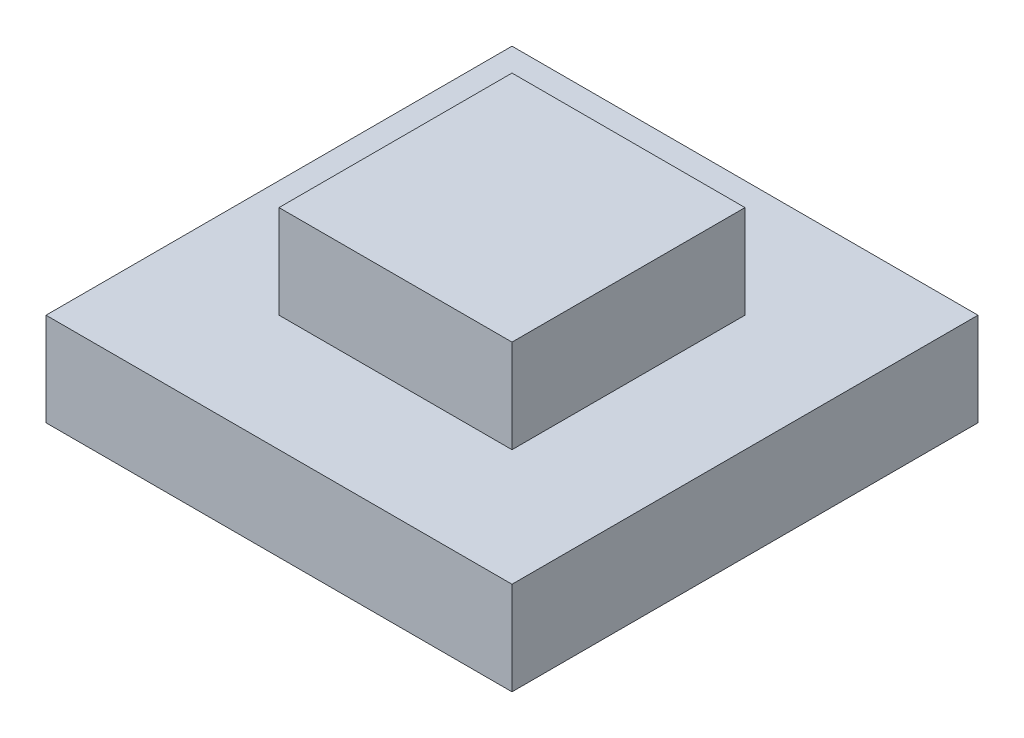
ISO-10303-21;
HEADER;
FILE_DESCRIPTION(('STEP AP214'),'2;1');
FILE_NAME('part.step','',(''),(''),'','','');
FILE_SCHEMA(('AUTOMOTIVE_DESIGN { 1 0 10303 214 1 1 1 1 }'));
ENDSEC;
DATA;
#1=APPLICATION_CONTEXT('core data for automotive mechanical design processes');
#2=APPLICATION_PROTOCOL_DEFINITION('international standard','automotive_design',2000,#1);
#3=PRODUCT_CONTEXT('',#1,'mechanical');
#4=PRODUCT('Part','Part','',(#3));
#5=PRODUCT_RELATED_PRODUCT_CATEGORY('part','',(#4));
#6=PRODUCT_DEFINITION_FORMATION('','',#4);
#7=PRODUCT_DEFINITION_CONTEXT('part definition',#1,'design');
#8=PRODUCT_DEFINITION('design','',#6,#7);
#9=PRODUCT_DEFINITION_SHAPE('','',#8);
#10=(LENGTH_UNIT() NAMED_UNIT(*) SI_UNIT(.MILLI.,.METRE.));
#11=(NAMED_UNIT(*) PLANE_ANGLE_UNIT() SI_UNIT($,.RADIAN.));
#12=(NAMED_UNIT(*) SI_UNIT($,.STERADIAN.) SOLID_ANGLE_UNIT());
#13=UNCERTAINTY_MEASURE_WITH_UNIT(LENGTH_MEASURE(1.E-05),#10,'distance_accuracy_value','');
#14=(GEOMETRIC_REPRESENTATION_CONTEXT(3) GLOBAL_UNCERTAINTY_ASSIGNED_CONTEXT((#13)) GLOBAL_UNIT_ASSIGNED_CONTEXT((#10,
#11,#12)) REPRESENTATION_CONTEXT('',''));
#15=CARTESIAN_POINT('',(0.,0.,0.));
#16=DIRECTION('',(0.,0.,1.));
#17=DIRECTION('',(1.,0.,0.));
#18=AXIS2_PLACEMENT_3D('',#15,#16,#17);
#19=CARTESIAN_POINT('',(-25.,40.,25.));
#20=DIRECTION('',(1.,0.,0.));
#21=DIRECTION('',(0.,0.,-1.));
#22=AXIS2_PLACEMENT_3D('',#19,#20,#21);
#23=PLANE('',#22);
#24=DIRECTION('',(0.,0.,1.));
#25=VECTOR('',#24,1.);
#26=CARTESIAN_POINT('',(-25.,20.,25.));
#27=LINE('',#26,#25);
#28=CARTESIAN_POINT('',(-25.,20.,-25.));
#29=VERTEX_POINT('',#28);
#30=CARTESIAN_POINT('',(-25.,20.,25.));
#31=VERTEX_POINT('',#30);
#32=EDGE_CURVE('E116',#29,#31,#27,.T.);
#33=ORIENTED_EDGE('',*,*,#32,.T.);
#34=DIRECTION('',(0.,-1.,0.));
#35=VECTOR('',#34,1.);
#36=CARTESIAN_POINT('',(-25.,40.,25.));
#37=LINE('',#36,#35);
#38=CARTESIAN_POINT('',(-25.,40.,25.));
#39=VERTEX_POINT('',#38);
#40=EDGE_CURVE('E12',#39,#31,#37,.T.);
#41=ORIENTED_EDGE('',*,*,#40,.F.);
#42=DIRECTION('',(0.,0.,1.));
#43=VECTOR('',#42,1.);
#44=CARTESIAN_POINT('',(-25.,40.,25.));
#45=LINE('',#44,#43);
#46=CARTESIAN_POINT('',(-25.,40.,-25.));
#47=VERTEX_POINT('',#46);
#48=EDGE_CURVE('E104',#47,#39,#45,.T.);
#49=ORIENTED_EDGE('',*,*,#48,.F.);
#50=DIRECTION('',(0.,-1.,0.));
#51=VECTOR('',#50,1.);
#52=CARTESIAN_POINT('',(-25.,40.,-25.));
#53=LINE('',#52,#51);
#54=EDGE_CURVE('E112',#47,#29,#53,.T.);
#55=ORIENTED_EDGE('',*,*,#54,.T.);
#56=EDGE_LOOP('',(#33,#41,#49,#55));
#57=FACE_BOUND('',#56,.T.);
#58=ADVANCED_FACE('F53',(#57),#23,.F.);
#59=CARTESIAN_POINT('',(25.,40.,25.));
#60=DIRECTION('',(0.,0.,-1.));
#61=DIRECTION('',(-1.,0.,0.));
#62=AXIS2_PLACEMENT_3D('',#59,#60,#61);
#63=PLANE('',#62);
#64=DIRECTION('',(1.,0.,0.));
#65=VECTOR('',#64,1.);
#66=CARTESIAN_POINT('',(25.,20.,25.));
#67=LINE('',#66,#65);
#68=CARTESIAN_POINT('',(25.,20.,25.));
#69=VERTEX_POINT('',#68);
#70=EDGE_CURVE('E108',#31,#69,#67,.T.);
#71=ORIENTED_EDGE('',*,*,#70,.T.);
#72=DIRECTION('',(0.,-1.,0.));
#73=VECTOR('',#72,1.);
#74=CARTESIAN_POINT('',(25.,40.,25.));
#75=LINE('',#74,#73);
#76=CARTESIAN_POINT('',(25.,40.,25.));
#77=VERTEX_POINT('',#76);
#78=EDGE_CURVE('E61',#77,#69,#75,.T.);
#79=ORIENTED_EDGE('',*,*,#78,.F.);
#80=DIRECTION('',(1.,0.,0.));
#81=VECTOR('',#80,1.);
#82=CARTESIAN_POINT('',(25.,40.,25.));
#83=LINE('',#82,#81);
#84=EDGE_CURVE('E99',#39,#77,#83,.T.);
#85=ORIENTED_EDGE('',*,*,#84,.F.);
#86=ORIENTED_EDGE('',*,*,#40,.T.);
#87=EDGE_LOOP('',(#71,#79,#85,#86));
#88=FACE_BOUND('',#87,.T.);
#89=ADVANCED_FACE('F107',(#88),#63,.F.);
#90=CARTESIAN_POINT('',(25.,40.,25.));
#91=DIRECTION('',(-1.,0.,0.));
#92=DIRECTION('',(0.,0.,1.));
#93=AXIS2_PLACEMENT_3D('',#90,#91,#92);
#94=PLANE('',#93);
#95=DIRECTION('',(0.,0.,-1.));
#96=VECTOR('',#95,1.);
#97=CARTESIAN_POINT('',(25.,20.,25.));
#98=LINE('',#97,#96);
#99=CARTESIAN_POINT('',(25.,20.,-25.));
#100=VERTEX_POINT('',#99);
#101=EDGE_CURVE('E86',#69,#100,#98,.T.);
#102=ORIENTED_EDGE('',*,*,#101,.T.);
#103=DIRECTION('',(0.,-1.,0.));
#104=VECTOR('',#103,1.);
#105=CARTESIAN_POINT('',(25.,40.,-25.));
#106=LINE('',#105,#104);
#107=CARTESIAN_POINT('',(25.,40.,-25.));
#108=VERTEX_POINT('',#107);
#109=EDGE_CURVE('E109',#108,#100,#106,.T.);
#110=ORIENTED_EDGE('',*,*,#109,.F.);
#111=DIRECTION('',(0.,0.,-1.));
#112=VECTOR('',#111,1.);
#113=CARTESIAN_POINT('',(25.,40.,25.));
#114=LINE('',#113,#112);
#115=EDGE_CURVE('E102',#77,#108,#114,.T.);
#116=ORIENTED_EDGE('',*,*,#115,.F.);
#117=ORIENTED_EDGE('',*,*,#78,.T.);
#118=EDGE_LOOP('',(#102,#110,#116,#117));
#119=FACE_BOUND('',#118,.T.);
#120=ADVANCED_FACE('F110',(#119),#94,.F.);
#121=CARTESIAN_POINT('',(25.,40.,-25.));
#122=DIRECTION('',(0.,0.,1.));
#123=DIRECTION('',(1.,0.,0.));
#124=AXIS2_PLACEMENT_3D('',#121,#122,#123);
#125=PLANE('',#124);
#126=DIRECTION('',(-1.,0.,0.));
#127=VECTOR('',#126,1.);
#128=CARTESIAN_POINT('',(25.,20.,-25.));
#129=LINE('',#128,#127);
#130=EDGE_CURVE('E92',#100,#29,#129,.T.);
#131=ORIENTED_EDGE('',*,*,#130,.T.);
#132=ORIENTED_EDGE('',*,*,#54,.F.);
#133=DIRECTION('',(-1.,0.,0.));
#134=VECTOR('',#133,1.);
#135=CARTESIAN_POINT('',(25.,40.,-25.));
#136=LINE('',#135,#134);
#137=EDGE_CURVE('E69',#108,#47,#136,.T.);
#138=ORIENTED_EDGE('',*,*,#137,.F.);
#139=ORIENTED_EDGE('',*,*,#109,.T.);
#140=EDGE_LOOP('',(#131,#132,#138,#139));
#141=FACE_BOUND('',#140,.T.);
#142=ADVANCED_FACE('F123',(#141),#125,.F.);
#143=CARTESIAN_POINT('',(0.,40.,0.));
#144=DIRECTION('',(0.,1.,0.));
#145=DIRECTION('',(0.,0.,1.));
#146=AXIS2_PLACEMENT_3D('',#143,#144,#145);
#147=PLANE('',#146);
#148=ORIENTED_EDGE('',*,*,#48,.T.);
#149=ORIENTED_EDGE('',*,*,#84,.T.);
#150=ORIENTED_EDGE('',*,*,#115,.T.);
#151=ORIENTED_EDGE('',*,*,#137,.T.);
#152=EDGE_LOOP('',(#148,#149,#150,#151));
#153=FACE_BOUND('',#152,.T.);
#154=ADVANCED_FACE('F100',(#153),#147,.T.);
#155=CARTESIAN_POINT('',(0.,20.,0.));
#156=DIRECTION('',(0.,1.,0.));
#157=DIRECTION('',(0.,0.,1.));
#158=AXIS2_PLACEMENT_3D('',#155,#156,#157);
#159=PLANE('',#158);
#160=ORIENTED_EDGE('',*,*,#32,.F.);
#161=ORIENTED_EDGE('',*,*,#130,.F.);
#162=ORIENTED_EDGE('',*,*,#101,.F.);
#163=ORIENTED_EDGE('',*,*,#70,.F.);
#164=EDGE_LOOP('',(#160,#161,#162,#163));
#165=FACE_BOUND('',#164,.T.);
#166=ADVANCED_FACE('F126',(#165),#159,.F.);
#167=CLOSED_SHELL('',(#58,#89,#120,#142,#154,#166));
#168=MANIFOLD_SOLID_BREP('B2',#167);
#169=CARTESIAN_POINT('',(-50.,20.,50.));
#170=DIRECTION('',(1.,0.,0.));
#171=DIRECTION('',(0.,0.,-1.));
#172=AXIS2_PLACEMENT_3D('',#169,#170,#171);
#173=PLANE('',#172);
#174=DIRECTION('',(0.,0.,1.));
#175=VECTOR('',#174,1.);
#176=CARTESIAN_POINT('',(-50.,0.,50.));
#177=LINE('',#176,#175);
#178=CARTESIAN_POINT('',(-50.,0.,-50.));
#179=VERTEX_POINT('',#178);
#180=CARTESIAN_POINT('',(-50.,0.,50.));
#181=VERTEX_POINT('',#180);
#182=EDGE_CURVE('E233',#179,#181,#177,.T.);
#183=ORIENTED_EDGE('',*,*,#182,.T.);
#184=DIRECTION('',(0.,-1.,0.));
#185=VECTOR('',#184,1.);
#186=CARTESIAN_POINT('',(-50.,20.,50.));
#187=LINE('',#186,#185);
#188=CARTESIAN_POINT('',(-50.,20.,50.));
#189=VERTEX_POINT('',#188);
#190=EDGE_CURVE('E51',#189,#181,#187,.T.);
#191=ORIENTED_EDGE('',*,*,#190,.F.);
#192=DIRECTION('',(0.,0.,1.));
#193=VECTOR('',#192,1.);
#194=CARTESIAN_POINT('',(-50.,20.,50.));
#195=LINE('',#194,#193);
#196=CARTESIAN_POINT('',(-50.,20.,-50.));
#197=VERTEX_POINT('',#196);
#198=EDGE_CURVE('E217',#197,#189,#195,.T.);
#199=ORIENTED_EDGE('',*,*,#198,.F.);
#200=DIRECTION('',(0.,-1.,0.));
#201=VECTOR('',#200,1.);
#202=CARTESIAN_POINT('',(-50.,20.,-50.));
#203=LINE('',#202,#201);
#204=EDGE_CURVE('E229',#197,#179,#203,.T.);
#205=ORIENTED_EDGE('',*,*,#204,.T.);
#206=EDGE_LOOP('',(#183,#191,#199,#205));
#207=FACE_BOUND('',#206,.T.);
#208=ADVANCED_FACE('F165',(#207),#173,.F.);
#209=CARTESIAN_POINT('',(50.,20.,50.));
#210=DIRECTION('',(0.,0.,-1.));
#211=DIRECTION('',(-1.,0.,0.));
#212=AXIS2_PLACEMENT_3D('',#209,#210,#211);
#213=PLANE('',#212);
#214=DIRECTION('',(1.,0.,0.));
#215=VECTOR('',#214,1.);
#216=CARTESIAN_POINT('',(50.,0.,50.));
#217=LINE('',#216,#215);
#218=CARTESIAN_POINT('',(50.,0.,50.));
#219=VERTEX_POINT('',#218);
#220=EDGE_CURVE('E222',#181,#219,#217,.T.);
#221=ORIENTED_EDGE('',*,*,#220,.T.);
#222=DIRECTION('',(0.,-1.,0.));
#223=VECTOR('',#222,1.);
#224=CARTESIAN_POINT('',(50.,20.,50.));
#225=LINE('',#224,#223);
#226=CARTESIAN_POINT('',(50.,20.,50.));
#227=VERTEX_POINT('',#226);
#228=EDGE_CURVE('E174',#227,#219,#225,.T.);
#229=ORIENTED_EDGE('',*,*,#228,.F.);
#230=DIRECTION('',(1.,0.,0.));
#231=VECTOR('',#230,1.);
#232=CARTESIAN_POINT('',(50.,20.,50.));
#233=LINE('',#232,#231);
#234=EDGE_CURVE('E212',#189,#227,#233,.T.);
#235=ORIENTED_EDGE('',*,*,#234,.F.);
#236=ORIENTED_EDGE('',*,*,#190,.T.);
#237=EDGE_LOOP('',(#221,#229,#235,#236));
#238=FACE_BOUND('',#237,.T.);
#239=ADVANCED_FACE('F221',(#238),#213,.F.);
#240=CARTESIAN_POINT('',(50.,20.,50.));
#241=DIRECTION('',(-1.,0.,0.));
#242=DIRECTION('',(0.,0.,1.));
#243=AXIS2_PLACEMENT_3D('',#240,#241,#242);
#244=PLANE('',#243);
#245=DIRECTION('',(0.,0.,-1.));
#246=VECTOR('',#245,1.);
#247=CARTESIAN_POINT('',(50.,0.,50.));
#248=LINE('',#247,#246);
#249=CARTESIAN_POINT('',(50.,0.,-50.));
#250=VERTEX_POINT('',#249);
#251=EDGE_CURVE('E199',#219,#250,#248,.T.);
#252=ORIENTED_EDGE('',*,*,#251,.T.);
#253=DIRECTION('',(0.,-1.,0.));
#254=VECTOR('',#253,1.);
#255=CARTESIAN_POINT('',(50.,20.,-50.));
#256=LINE('',#255,#254);
#257=CARTESIAN_POINT('',(50.,20.,-50.));
#258=VERTEX_POINT('',#257);
#259=EDGE_CURVE('E224',#258,#250,#256,.T.);
#260=ORIENTED_EDGE('',*,*,#259,.F.);
#261=DIRECTION('',(0.,0.,-1.));
#262=VECTOR('',#261,1.);
#263=CARTESIAN_POINT('',(50.,20.,50.));
#264=LINE('',#263,#262);
#265=EDGE_CURVE('E215',#227,#258,#264,.T.);
#266=ORIENTED_EDGE('',*,*,#265,.F.);
#267=ORIENTED_EDGE('',*,*,#228,.T.);
#268=EDGE_LOOP('',(#252,#260,#266,#267));
#269=FACE_BOUND('',#268,.T.);
#270=ADVANCED_FACE('F225',(#269),#244,.F.);
#271=CARTESIAN_POINT('',(50.,20.,-50.));
#272=DIRECTION('',(0.,0.,1.));
#273=DIRECTION('',(1.,0.,0.));
#274=AXIS2_PLACEMENT_3D('',#271,#272,#273);
#275=PLANE('',#274);
#276=DIRECTION('',(-1.,0.,0.));
#277=VECTOR('',#276,1.);
#278=CARTESIAN_POINT('',(50.,0.,-50.));
#279=LINE('',#278,#277);
#280=EDGE_CURVE('E205',#250,#179,#279,.T.);
#281=ORIENTED_EDGE('',*,*,#280,.T.);
#282=ORIENTED_EDGE('',*,*,#204,.F.);
#283=DIRECTION('',(-1.,0.,0.));
#284=VECTOR('',#283,1.);
#285=CARTESIAN_POINT('',(50.,20.,-50.));
#286=LINE('',#285,#284);
#287=EDGE_CURVE('E182',#258,#197,#286,.T.);
#288=ORIENTED_EDGE('',*,*,#287,.F.);
#289=ORIENTED_EDGE('',*,*,#259,.T.);
#290=EDGE_LOOP('',(#281,#282,#288,#289));
#291=FACE_BOUND('',#290,.T.);
#292=ADVANCED_FACE('F246',(#291),#275,.F.);
#293=CARTESIAN_POINT('',(0.,20.,0.));
#294=DIRECTION('',(0.,1.,0.));
#295=DIRECTION('',(0.,0.,1.));
#296=AXIS2_PLACEMENT_3D('',#293,#294,#295);
#297=PLANE('',#296);
#298=ORIENTED_EDGE('',*,*,#198,.T.);
#299=ORIENTED_EDGE('',*,*,#234,.T.);
#300=ORIENTED_EDGE('',*,*,#265,.T.);
#301=ORIENTED_EDGE('',*,*,#287,.T.);
#302=EDGE_LOOP('',(#298,#299,#300,#301));
#303=FACE_BOUND('',#302,.T.);
#304=ADVANCED_FACE('F213',(#303),#297,.T.);
#305=CARTESIAN_POINT('',(0.,0.,0.));
#306=DIRECTION('',(0.,1.,0.));
#307=DIRECTION('',(0.,0.,1.));
#308=AXIS2_PLACEMENT_3D('',#305,#306,#307);
#309=PLANE('',#308);
#310=ORIENTED_EDGE('',*,*,#182,.F.);
#311=ORIENTED_EDGE('',*,*,#280,.F.);
#312=ORIENTED_EDGE('',*,*,#251,.F.);
#313=ORIENTED_EDGE('',*,*,#220,.F.);
#314=EDGE_LOOP('',(#310,#311,#312,#313));
#315=FACE_BOUND('',#314,.T.);
#316=ADVANCED_FACE('F249',(#315),#309,.F.);
#317=CLOSED_SHELL('',(#208,#239,#270,#292,#304,#316));
#318=MANIFOLD_SOLID_BREP('B6',#317);
#319=ADVANCED_BREP_SHAPE_REPRESENTATION('',(#18,#168,#318),#14);
#320=SHAPE_DEFINITION_REPRESENTATION(#9,#319);
ENDSEC;
END-ISO-10303-21;
